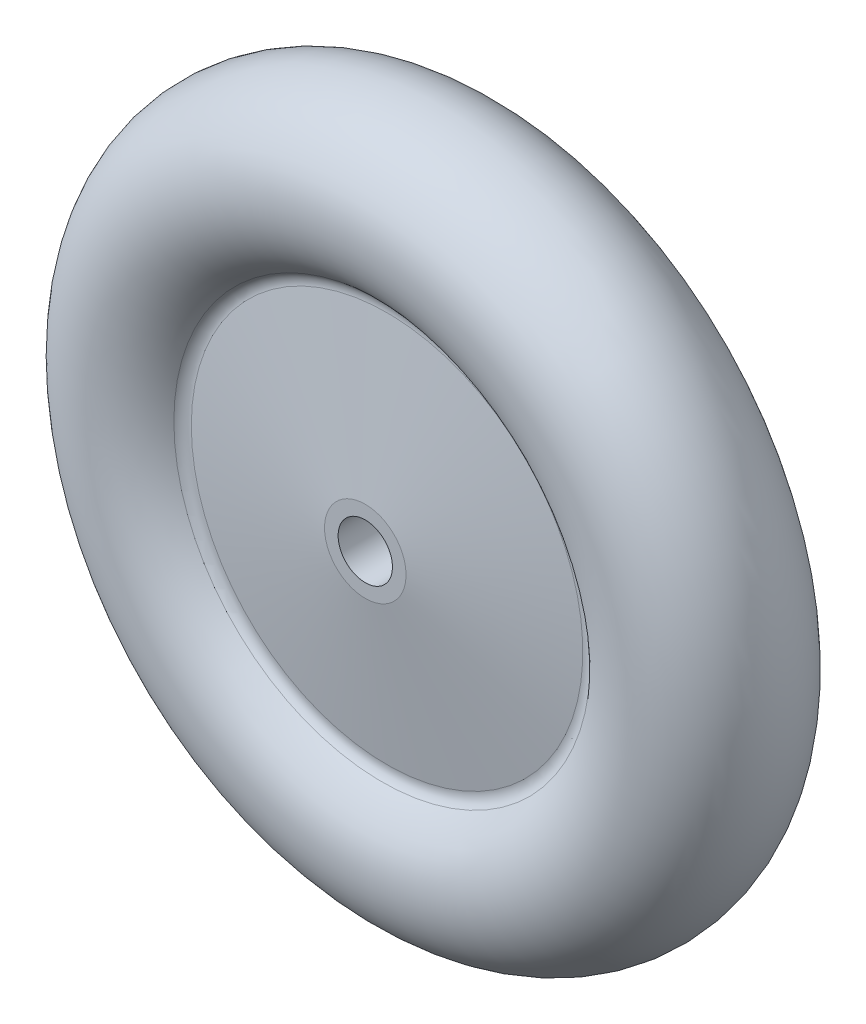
ISO-10303-21;
HEADER;
FILE_DESCRIPTION(('STEP AP214'),'2;1');
FILE_NAME('part.step','',(''),(''),'','','');
FILE_SCHEMA(('AUTOMOTIVE_DESIGN { 1 0 10303 214 1 1 1 1 }'));
ENDSEC;
DATA;
#1=APPLICATION_CONTEXT('core data for automotive mechanical design processes');
#2=APPLICATION_PROTOCOL_DEFINITION('international standard','automotive_design',2000,#1);
#3=PRODUCT_CONTEXT('',#1,'mechanical');
#4=PRODUCT('Part','Part','',(#3));
#5=PRODUCT_RELATED_PRODUCT_CATEGORY('part','',(#4));
#6=PRODUCT_DEFINITION_FORMATION('','',#4);
#7=PRODUCT_DEFINITION_CONTEXT('part definition',#1,'design');
#8=PRODUCT_DEFINITION('design','',#6,#7);
#9=PRODUCT_DEFINITION_SHAPE('','',#8);
#10=(LENGTH_UNIT() NAMED_UNIT(*) SI_UNIT(.MILLI.,.METRE.));
#11=(NAMED_UNIT(*) PLANE_ANGLE_UNIT() SI_UNIT($,.RADIAN.));
#12=(NAMED_UNIT(*) SI_UNIT($,.STERADIAN.) SOLID_ANGLE_UNIT());
#13=UNCERTAINTY_MEASURE_WITH_UNIT(LENGTH_MEASURE(1.E-05),#10,'distance_accuracy_value','');
#14=(GEOMETRIC_REPRESENTATION_CONTEXT(3) GLOBAL_UNCERTAINTY_ASSIGNED_CONTEXT((#13)) GLOBAL_UNIT_ASSIGNED_CONTEXT((#10,
#11,#12)) REPRESENTATION_CONTEXT('',''));
#15=CARTESIAN_POINT('',(0.,0.,0.));
#16=DIRECTION('',(0.,0.,1.));
#17=DIRECTION('',(1.,0.,0.));
#18=AXIS2_PLACEMENT_3D('',#15,#16,#17);
#19=CARTESIAN_POINT('',(0.,2.,-5.));
#20=DIRECTION('',(0.,0.,-1.));
#21=DIRECTION('',(-1.,0.,0.));
#22=AXIS2_PLACEMENT_3D('',#19,#20,#21);
#23=PLANE('',#22);
#24=CARTESIAN_POINT('',(0.,0.,-5.));
#25=DIRECTION('',(0.,0.,-1.));
#26=DIRECTION('',(-1.,0.,0.));
#27=AXIS2_PLACEMENT_3D('',#24,#25,#26);
#28=CIRCLE('',#27,3.);
#29=CARTESIAN_POINT('',(3.,0.,-5.));
#30=VERTEX_POINT('',#29);
#31=EDGE_CURVE('E10',#30,#30,#28,.T.);
#32=ORIENTED_EDGE('',*,*,#31,.T.);
#33=EDGE_LOOP('',(#32));
#34=FACE_BOUND('',#33,.T.);
#35=CARTESIAN_POINT('',(0.,0.,-5.));
#36=DIRECTION('',(0.,0.,-1.));
#37=DIRECTION('',(-1.,0.,0.));
#38=AXIS2_PLACEMENT_3D('',#35,#36,#37);
#39=CIRCLE('',#38,2.);
#40=CARTESIAN_POINT('',(-2.,0.,-5.));
#41=VERTEX_POINT('',#40);
#42=EDGE_CURVE('E57',#41,#41,#39,.T.);
#43=ORIENTED_EDGE('',*,*,#42,.F.);
#44=EDGE_LOOP('',(#43));
#45=FACE_BOUND('',#44,.T.);
#46=ADVANCED_FACE('F29',(#34,#45),#23,.T.);
#47=CARTESIAN_POINT('',(0.,0.,-5.));
#48=DIRECTION('',(0.,0.,1.));
#49=DIRECTION('',(1.,0.,0.));
#50=AXIS2_PLACEMENT_3D('',#47,#48,#49);
#51=CONICAL_SURFACE('',#50,3.,1.43119483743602);
#52=CARTESIAN_POINT('',(0.,0.,-3.39721066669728));
#53=DIRECTION('',(0.,0.,-1.));
#54=DIRECTION('',(-1.,0.,0.));
#55=AXIS2_PLACEMENT_3D('',#52,#53,#54);
#56=CIRCLE('',#55,14.4064954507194);
#57=CARTESIAN_POINT('',(14.4064954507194,0.,-3.39721066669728));
#58=VERTEX_POINT('',#57);
#59=EDGE_CURVE('E35',#58,#58,#56,.T.);
#60=CARTESIAN_POINT('',(14.4064954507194,0.,-3.39721066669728));
#61=CARTESIAN_POINT('',(14.2876777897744,0.,-3.41390638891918));
#62=CARTESIAN_POINT('',(14.1688601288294,0.,-3.43060211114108));
#63=CARTESIAN_POINT('',(13.9312248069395,0.,-3.46399355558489));
#64=CARTESIAN_POINT('',(13.8124071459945,0.,-3.48068927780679));
#65=CARTESIAN_POINT('',(13.5747718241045,0.,-3.5140807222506));
#66=CARTESIAN_POINT('',(13.4559541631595,0.,-3.5307764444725));
#67=CARTESIAN_POINT('',(13.2183188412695,0.,-3.56416788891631));
#68=CARTESIAN_POINT('',(13.0995011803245,0.,-3.58086361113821));
#69=CARTESIAN_POINT('',(12.8618658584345,0.,-3.61425505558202));
#70=CARTESIAN_POINT('',(12.7430481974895,0.,-3.63095077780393));
#71=CARTESIAN_POINT('',(12.5054128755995,0.,-3.66434222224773));
#72=CARTESIAN_POINT('',(12.3865952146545,0.,-3.68103794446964));
#73=CARTESIAN_POINT('',(12.1489598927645,0.,-3.71442938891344));
#74=CARTESIAN_POINT('',(12.0301422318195,0.,-3.73112511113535));
#75=CARTESIAN_POINT('',(11.7925069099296,0.,-3.76451655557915));
#76=CARTESIAN_POINT('',(11.6736892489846,0.,-3.78121227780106));
#77=CARTESIAN_POINT('',(11.4360539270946,0.,-3.81460372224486));
#78=CARTESIAN_POINT('',(11.3172362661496,0.,-3.83129944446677));
#79=CARTESIAN_POINT('',(11.0796009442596,0.,-3.86469088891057));
#80=CARTESIAN_POINT('',(10.9607832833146,0.,-3.88138661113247));
#81=CARTESIAN_POINT('',(10.7231479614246,0.,-3.91477805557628));
#82=CARTESIAN_POINT('',(10.6043303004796,0.,-3.93147377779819));
#83=CARTESIAN_POINT('',(10.3666949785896,0.,-3.96486522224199));
#84=CARTESIAN_POINT('',(10.2478773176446,0.,-3.9815609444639));
#85=CARTESIAN_POINT('',(10.0102419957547,0.,-4.0149523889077));
#86=CARTESIAN_POINT('',(9.89142433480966,0.,-4.0316481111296));
#87=CARTESIAN_POINT('',(9.65378901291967,0.,-4.06503955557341));
#88=CARTESIAN_POINT('',(9.53497135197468,0.,-4.08173527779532));
#89=CARTESIAN_POINT('',(9.29733603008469,0.,-4.11512672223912));
#90=CARTESIAN_POINT('',(9.17851836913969,0.,-4.13182244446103));
#91=CARTESIAN_POINT('',(8.9408830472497,0.,-4.16521388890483));
#92=CARTESIAN_POINT('',(8.82206538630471,0.,-4.18190961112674));
#93=CARTESIAN_POINT('',(8.58443006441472,0.,-4.21530105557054));
#94=CARTESIAN_POINT('',(8.46561240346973,0.,-4.23199677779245));
#95=CARTESIAN_POINT('',(8.22797708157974,0.,-4.26538822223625));
#96=CARTESIAN_POINT('',(8.10915942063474,0.,-4.28208394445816));
#97=CARTESIAN_POINT('',(7.87152409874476,0.,-4.31547538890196));
#98=CARTESIAN_POINT('',(7.75270643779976,0.,-4.33217111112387));
#99=CARTESIAN_POINT('',(7.51507111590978,0.,-4.36556255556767));
#100=CARTESIAN_POINT('',(7.39625345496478,0.,-4.38225827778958));
#101=CARTESIAN_POINT('',(7.15861813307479,0.,-4.41564972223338));
#102=CARTESIAN_POINT('',(7.0398004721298,0.,-4.43234544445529));
#103=CARTESIAN_POINT('',(6.80216515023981,0.,-4.46573688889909));
#104=CARTESIAN_POINT('',(6.68334748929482,0.,-4.482432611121));
#105=CARTESIAN_POINT('',(6.44571216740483,0.,-4.5158240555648));
#106=CARTESIAN_POINT('',(6.32689450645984,0.,-4.53251977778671));
#107=CARTESIAN_POINT('',(6.08925918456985,0.,-4.56591122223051));
#108=CARTESIAN_POINT('',(5.97044152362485,0.,-4.58260694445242));
#109=CARTESIAN_POINT('',(5.73280620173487,0.,-4.61599838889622));
#110=CARTESIAN_POINT('',(5.61398854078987,0.,-4.63269411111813));
#111=CARTESIAN_POINT('',(5.37635321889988,0.,-4.66608555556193));
#112=CARTESIAN_POINT('',(5.25753555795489,0.,-4.68278127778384));
#113=CARTESIAN_POINT('',(5.0199002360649,0.,-4.71617272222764));
#114=CARTESIAN_POINT('',(4.90108257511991,0.,-4.73286844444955));
#115=CARTESIAN_POINT('',(4.66344725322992,0.,-4.76625988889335));
#116=CARTESIAN_POINT('',(4.54462959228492,0.,-4.78295561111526));
#117=CARTESIAN_POINT('',(4.30699427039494,0.,-4.81634705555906));
#118=CARTESIAN_POINT('',(4.18817660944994,0.,-4.83304277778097));
#119=CARTESIAN_POINT('',(3.95054128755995,0.,-4.86643422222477));
#120=CARTESIAN_POINT('',(3.83172362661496,0.,-4.88312994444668));
#121=CARTESIAN_POINT('',(3.59408830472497,0.,-4.91652138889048));
#122=CARTESIAN_POINT('',(3.47527064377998,0.,-4.93321711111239));
#123=CARTESIAN_POINT('',(3.23763532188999,0.,-4.96660855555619));
#124=CARTESIAN_POINT('',(3.118817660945,0.,-4.9833042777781));
#125=CARTESIAN_POINT('',(3.,0.,-5.));
#126=B_SPLINE_CURVE_WITH_KNOTS('',3,(#60,#61,#62,#63,#64,#65,#66,#67,#68,#69,#70,#71,#72,#73,
#74,#75,#76,#77,#78,#79,#80,#81,#82,#83,#84,#85,#86,#87,#88,#89,#90,#91,#92,#93,#94,#95,#96,#97,
#98,#99,#100,#101,#102,#103,#104,#105,#106,#107,#108,#109,#110,#111,#112,#113,#114,#115,#116,
#117,#118,#119,#120,#121,#122,#123,#124,#125),.UNSPECIFIED.,.F.,.F.,(4,2,2,2,2,2,2,2,2,2,2,2,2,
2,2,2,2,2,2,2,2,2,2,2,2,2,2,2,2,2,2,2,4),(0.,0.359954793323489,0.719909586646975,
1.07986437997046,1.43981917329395,1.79977396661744,2.15972875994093,2.51968355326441,
2.8796383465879,3.23959313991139,3.59954793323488,3.95950272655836,4.31945751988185,
4.67941231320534,5.03936710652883,5.39932189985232,5.7592766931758,6.11923148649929,
6.47918627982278,6.83914107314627,7.19909586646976,7.55905065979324,7.91900545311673,
8.27896024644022,8.6389150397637,8.99886983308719,9.35882462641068,9.71877941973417,
10.0787342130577,10.4386890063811,10.7986437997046,11.1585985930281,11.5185533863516),.UNSPECIFIED.);
#127=EDGE_CURVE('BSEAM65',#58,#30,#126,.T.);
#128=ORIENTED_EDGE('',*,*,#59,.T.);
#129=ORIENTED_EDGE('',*,*,#31,.F.);
#130=ORIENTED_EDGE('',*,*,#127,.T.);
#131=ORIENTED_EDGE('',*,*,#127,.F.);
#132=EDGE_LOOP('',(#128,#130,#129,#131));
#133=FACE_BOUND('',#132,.T.);
#134=ADVANCED_FACE('F65',(#133),#51,.T.);
#135=CARTESIAN_POINT('',(0.,0.,-4.38748219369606));
#136=DIRECTION('',(0.,0.,-1.));
#137=DIRECTION('',(-1.,0.,0.));
#138=AXIS2_PLACEMENT_3D('',#135,#136,#137);
#139=TOROIDAL_SURFACE('',#138,14.5456439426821,1.);
#140=CARTESIAN_POINT('',(0.,0.,-3.76069902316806));
#141=DIRECTION('',(0.,0.,-1.));
#142=DIRECTION('',(-1.,0.,0.));
#143=AXIS2_PLACEMENT_3D('',#140,#141,#142);
#144=CIRCLE('',#143,15.3248376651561);
#145=CARTESIAN_POINT('',(-15.3248376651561,0.,-3.76069902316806));
#146=VERTEX_POINT('',#145);
#147=EDGE_CURVE('E39',#146,#146,#144,.T.);
#148=ORIENTED_EDGE('',*,*,#147,.T.);
#149=EDGE_LOOP('',(#148));
#150=FACE_BOUND('',#149,.T.);
#151=ORIENTED_EDGE('',*,*,#59,.F.);
#152=EDGE_LOOP('',(#151));
#153=FACE_BOUND('',#152,.T.);
#154=ADVANCED_FACE('F69',(#150,#153),#139,.F.);
#155=CARTESIAN_POINT('',(0.,0.,0.));
#156=DIRECTION('',(0.,0.,-1.));
#157=DIRECTION('',(-1.,0.,0.));
#158=AXIS2_PLACEMENT_3D('',#155,#156,#157);
#159=TOROIDAL_SURFACE('',#158,20.,6.);
#160=CARTESIAN_POINT('',(0.,0.,3.76069902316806));
#161=DIRECTION('',(0.,0.,-1.));
#162=DIRECTION('',(-1.,0.,0.));
#163=AXIS2_PLACEMENT_3D('',#160,#161,#162);
#164=CIRCLE('',#163,15.3248376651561);
#165=CARTESIAN_POINT('',(-15.3248376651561,0.,3.76069902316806));
#166=VERTEX_POINT('',#165);
#167=EDGE_CURVE('E43',#166,#166,#164,.T.);
#168=ORIENTED_EDGE('',*,*,#167,.T.);
#169=EDGE_LOOP('',(#168));
#170=FACE_BOUND('',#169,.T.);
#171=ORIENTED_EDGE('',*,*,#147,.F.);
#172=EDGE_LOOP('',(#171));
#173=FACE_BOUND('',#172,.T.);
#174=ADVANCED_FACE('F73',(#170,#173),#159,.T.);
#175=CARTESIAN_POINT('',(0.,0.,4.38748219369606));
#176=DIRECTION('',(0.,0.,-1.));
#177=DIRECTION('',(-1.,0.,0.));
#178=AXIS2_PLACEMENT_3D('',#175,#176,#177);
#179=TOROIDAL_SURFACE('',#178,14.5456439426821,1.);
#180=CARTESIAN_POINT('',(0.,0.,3.39721066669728));
#181=DIRECTION('',(0.,0.,-1.));
#182=DIRECTION('',(-1.,0.,0.));
#183=AXIS2_PLACEMENT_3D('',#180,#181,#182);
#184=CIRCLE('',#183,14.4064954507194);
#185=CARTESIAN_POINT('',(-14.4064954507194,0.,3.39721066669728));
#186=VERTEX_POINT('',#185);
#187=EDGE_CURVE('E48',#186,#186,#184,.T.);
#188=ORIENTED_EDGE('',*,*,#187,.T.);
#189=EDGE_LOOP('',(#188));
#190=FACE_BOUND('',#189,.T.);
#191=ORIENTED_EDGE('',*,*,#167,.F.);
#192=EDGE_LOOP('',(#191));
#193=FACE_BOUND('',#192,.T.);
#194=ADVANCED_FACE('F80',(#190,#193),#179,.F.);
#195=CARTESIAN_POINT('',(0.,0.,3.39721066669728));
#196=DIRECTION('',(0.,0.,-1.));
#197=DIRECTION('',(-1.,0.,0.));
#198=AXIS2_PLACEMENT_3D('',#195,#196,#197);
#199=CONICAL_SURFACE('',#198,14.4064954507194,1.43119483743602);
#200=CARTESIAN_POINT('',(0.,0.,5.));
#201=DIRECTION('',(0.,0.,-1.));
#202=DIRECTION('',(-1.,0.,0.));
#203=AXIS2_PLACEMENT_3D('',#200,#201,#202);
#204=CIRCLE('',#203,3.);
#205=CARTESIAN_POINT('',(-3.,0.,5.));
#206=VERTEX_POINT('',#205);
#207=EDGE_CURVE('E51',#206,#206,#204,.T.);
#208=CARTESIAN_POINT('',(-3.,0.,5.));
#209=CARTESIAN_POINT('',(-3.118817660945,0.,4.9833042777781));
#210=CARTESIAN_POINT('',(-3.23763532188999,0.,4.96660855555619));
#211=CARTESIAN_POINT('',(-3.47527064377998,0.,4.93321711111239));
#212=CARTESIAN_POINT('',(-3.59408830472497,0.,4.91652138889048));
#213=CARTESIAN_POINT('',(-3.83172362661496,0.,4.88312994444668));
#214=CARTESIAN_POINT('',(-3.95054128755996,0.,4.86643422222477));
#215=CARTESIAN_POINT('',(-4.18817660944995,0.,4.83304277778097));
#216=CARTESIAN_POINT('',(-4.30699427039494,0.,4.81634705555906));
#217=CARTESIAN_POINT('',(-4.54462959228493,0.,4.78295561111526));
#218=CARTESIAN_POINT('',(-4.66344725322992,0.,4.76625988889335));
#219=CARTESIAN_POINT('',(-4.90108257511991,0.,4.73286844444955));
#220=CARTESIAN_POINT('',(-5.0199002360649,0.,4.71617272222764));
#221=CARTESIAN_POINT('',(-5.25753555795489,0.,4.68278127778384));
#222=CARTESIAN_POINT('',(-5.37635321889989,0.,4.66608555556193));
#223=CARTESIAN_POINT('',(-5.61398854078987,0.,4.63269411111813));
#224=CARTESIAN_POINT('',(-5.73280620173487,0.,4.61599838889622));
#225=CARTESIAN_POINT('',(-5.97044152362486,0.,4.58260694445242));
#226=CARTESIAN_POINT('',(-6.08925918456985,0.,4.56591122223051));
#227=CARTESIAN_POINT('',(-6.32689450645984,0.,4.53251977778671));
#228=CARTESIAN_POINT('',(-6.44571216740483,0.,4.5158240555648));
#229=CARTESIAN_POINT('',(-6.68334748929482,0.,4.482432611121));
#230=CARTESIAN_POINT('',(-6.80216515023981,0.,4.46573688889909));
#231=CARTESIAN_POINT('',(-7.0398004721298,0.,4.43234544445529));
#232=CARTESIAN_POINT('',(-7.1586181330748,0.,4.41564972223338));
#233=CARTESIAN_POINT('',(-7.39625345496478,0.,4.38225827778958));
#234=CARTESIAN_POINT('',(-7.51507111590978,0.,4.36556255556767));
#235=CARTESIAN_POINT('',(-7.75270643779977,0.,4.33217111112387));
#236=CARTESIAN_POINT('',(-7.87152409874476,0.,4.31547538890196));
#237=CARTESIAN_POINT('',(-8.10915942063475,0.,4.28208394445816));
#238=CARTESIAN_POINT('',(-8.22797708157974,0.,4.26538822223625));
#239=CARTESIAN_POINT('',(-8.46561240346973,0.,4.23199677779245));
#240=CARTESIAN_POINT('',(-8.58443006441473,0.,4.21530105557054));
#241=CARTESIAN_POINT('',(-8.82206538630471,0.,4.18190961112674));
#242=CARTESIAN_POINT('',(-8.94088304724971,0.,4.16521388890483));
#243=CARTESIAN_POINT('',(-9.1785183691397,0.,4.13182244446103));
#244=CARTESIAN_POINT('',(-9.29733603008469,0.,4.11512672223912));
#245=CARTESIAN_POINT('',(-9.53497135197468,0.,4.08173527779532));
#246=CARTESIAN_POINT('',(-9.65378901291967,0.,4.06503955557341));
#247=CARTESIAN_POINT('',(-9.89142433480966,0.,4.03164811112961));
#248=CARTESIAN_POINT('',(-10.0102419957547,0.,4.0149523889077));
#249=CARTESIAN_POINT('',(-10.2478773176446,0.,3.9815609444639));
#250=CARTESIAN_POINT('',(-10.3666949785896,0.,3.96486522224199));
#251=CARTESIAN_POINT('',(-10.6043303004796,0.,3.93147377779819));
#252=CARTESIAN_POINT('',(-10.7231479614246,0.,3.91477805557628));
#253=CARTESIAN_POINT('',(-10.9607832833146,0.,3.88138661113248));
#254=CARTESIAN_POINT('',(-11.0796009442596,0.,3.86469088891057));
#255=CARTESIAN_POINT('',(-11.3172362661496,0.,3.83129944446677));
#256=CARTESIAN_POINT('',(-11.4360539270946,0.,3.81460372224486));
#257=CARTESIAN_POINT('',(-11.6736892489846,0.,3.78121227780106));
#258=CARTESIAN_POINT('',(-11.7925069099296,0.,3.76451655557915));
#259=CARTESIAN_POINT('',(-12.0301422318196,0.,3.73112511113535));
#260=CARTESIAN_POINT('',(-12.1489598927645,0.,3.71442938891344));
#261=CARTESIAN_POINT('',(-12.3865952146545,0.,3.68103794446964));
#262=CARTESIAN_POINT('',(-12.5054128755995,0.,3.66434222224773));
#263=CARTESIAN_POINT('',(-12.7430481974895,0.,3.63095077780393));
#264=CARTESIAN_POINT('',(-12.8618658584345,0.,3.61425505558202));
#265=CARTESIAN_POINT('',(-13.0995011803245,0.,3.58086361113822));
#266=CARTESIAN_POINT('',(-13.2183188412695,0.,3.56416788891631));
#267=CARTESIAN_POINT('',(-13.4559541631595,0.,3.53077644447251));
#268=CARTESIAN_POINT('',(-13.5747718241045,0.,3.5140807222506));
#269=CARTESIAN_POINT('',(-13.8124071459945,0.,3.4806892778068));
#270=CARTESIAN_POINT('',(-13.9312248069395,0.,3.46399355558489));
#271=CARTESIAN_POINT('',(-14.1688601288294,0.,3.43060211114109));
#272=CARTESIAN_POINT('',(-14.2876777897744,0.,3.41390638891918));
#273=CARTESIAN_POINT('',(-14.4064954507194,0.,3.39721066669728));
#274=B_SPLINE_CURVE_WITH_KNOTS('',3,(#208,#209,#210,#211,#212,#213,#214,#215,#216,#217,#218,
#219,#220,#221,#222,#223,#224,#225,#226,#227,#228,#229,#230,#231,#232,#233,#234,#235,#236,#237,
#238,#239,#240,#241,#242,#243,#244,#245,#246,#247,#248,#249,#250,#251,#252,#253,#254,#255,#256,
#257,#258,#259,#260,#261,#262,#263,#264,#265,#266,#267,#268,#269,#270,#271,#272,#273),
.UNSPECIFIED.,.F.,.F.,(4,2,2,2,2,2,2,2,2,2,2,2,2,2,2,2,2,2,2,2,2,2,2,2,2,2,2,2,2,2,2,2,4),(0.,
0.359954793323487,0.719909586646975,1.07986437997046,1.43981917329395,1.79977396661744,
2.15972875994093,2.51968355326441,2.8796383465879,3.23959313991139,3.59954793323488,
3.95950272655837,4.31945751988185,4.67941231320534,5.03936710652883,5.39932189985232,
5.75927669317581,6.11923148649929,6.47918627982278,6.83914107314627,7.19909586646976,
7.55905065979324,7.91900545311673,8.27896024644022,8.63891503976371,8.9988698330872,
9.35882462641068,9.71877941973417,10.0787342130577,10.4386890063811,10.7986437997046,
11.1585985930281,11.5185533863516),.UNSPECIFIED.);
#275=EDGE_CURVE('BSEAM84',#206,#186,#274,.T.);
#276=ORIENTED_EDGE('',*,*,#207,.T.);
#277=ORIENTED_EDGE('',*,*,#187,.F.);
#278=ORIENTED_EDGE('',*,*,#275,.T.);
#279=ORIENTED_EDGE('',*,*,#275,.F.);
#280=EDGE_LOOP('',(#276,#278,#277,#279));
#281=FACE_BOUND('',#280,.T.);
#282=ADVANCED_FACE('F84',(#281),#199,.T.);
#283=CARTESIAN_POINT('',(0.,2.,5.));
#284=DIRECTION('',(0.,0.,1.));
#285=DIRECTION('',(1.,0.,0.));
#286=AXIS2_PLACEMENT_3D('',#283,#284,#285);
#287=PLANE('',#286);
#288=CARTESIAN_POINT('',(0.,0.,5.));
#289=DIRECTION('',(0.,0.,-1.));
#290=DIRECTION('',(-1.,0.,0.));
#291=AXIS2_PLACEMENT_3D('',#288,#289,#290);
#292=CIRCLE('',#291,2.);
#293=CARTESIAN_POINT('',(-2.,0.,5.));
#294=VERTEX_POINT('',#293);
#295=EDGE_CURVE('E54',#294,#294,#292,.T.);
#296=ORIENTED_EDGE('',*,*,#295,.T.);
#297=EDGE_LOOP('',(#296));
#298=FACE_BOUND('',#297,.T.);
#299=ORIENTED_EDGE('',*,*,#207,.F.);
#300=EDGE_LOOP('',(#299));
#301=FACE_BOUND('',#300,.T.);
#302=ADVANCED_FACE('F88',(#298,#301),#287,.T.);
#303=CARTESIAN_POINT('',(0.,0.,-18.1622037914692));
#304=DIRECTION('',(0.,0.,-1.));
#305=DIRECTION('',(-1.,0.,0.));
#306=AXIS2_PLACEMENT_3D('',#303,#304,#305);
#307=CYLINDRICAL_SURFACE('',#306,2.);
#308=ORIENTED_EDGE('',*,*,#42,.T.);
#309=EDGE_LOOP('',(#308));
#310=FACE_BOUND('',#309,.T.);
#311=ORIENTED_EDGE('',*,*,#295,.F.);
#312=EDGE_LOOP('',(#311));
#313=FACE_BOUND('',#312,.T.);
#314=ADVANCED_FACE('F61',(#310,#313),#307,.F.);
#315=CLOSED_SHELL('',(#46,#134,#154,#174,#194,#282,#302,#314));
#316=MANIFOLD_SOLID_BREP('B2',#315);
#317=ADVANCED_BREP_SHAPE_REPRESENTATION('',(#18,#316),#14);
#318=SHAPE_DEFINITION_REPRESENTATION(#9,#317);
ENDSEC;
END-ISO-10303-21;
